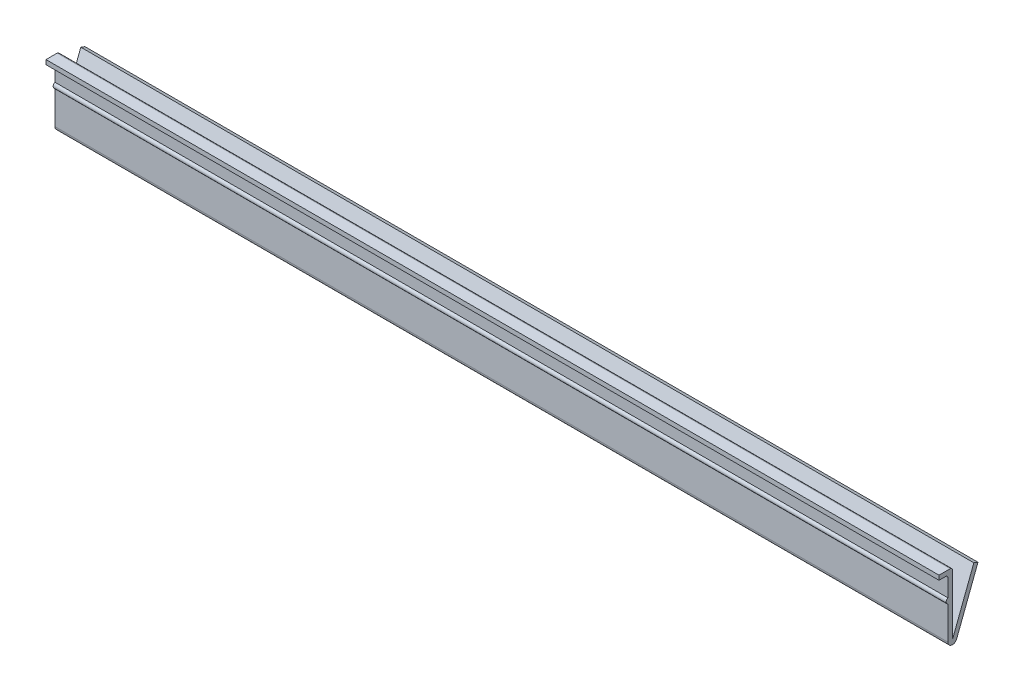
from build123d import *

# Parameters (mm, degrees)
ASENNUSLISTAT_1_6002_ASENNUSLISTA_45_1_DEPTH = 200


with BuildPart() as part:
    # Sketch1 → Asennuslistat 1.6002 ASENNUSLISTA 45_1 (new body)
    with BuildSketch(Plane(origin=(0, 0, 0), x_dir=(0, 0, -1), z_dir=(1, 0, 0))):
        with BuildLine():
            Line((-5.031152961, 10.117620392), (-2.531152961, 10.117620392))
            ThreePointArc((-2.531152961, 10.117620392), (-2.17759957, 9.971173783), (-2.031152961, 9.617620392))
            Line((-2.031152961, 9.617620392), (-2.031152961, -3.876083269))
            ThreePointArc((-2.031152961, -3.876083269), (-2.025913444, -3.882379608), (-2.018769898, -3.878371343))
            Line((-2.018769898, -3.878371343), (2.762345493, 8.617620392))
            Line((2.762345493, 8.617620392), (3.696316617, 8.260271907))
            Line((3.696316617, 8.260271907), (-1.084798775, -4.235719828))
            ThreePointArc((-1.084798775, -4.235719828), (-2.2076122, -4.865733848), (-3.031152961, -3.876083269))
            Line((-3.031152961, -3.876083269), (-3.031152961, 3.517877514))
            ThreePointArc((-3.031152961, 3.517877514), (-3.430536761, 4.117620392), (-3.031152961, 4.717363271))
            Line((-3.031152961, 4.717363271), (-3.031152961, 8.617620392))
            ThreePointArc((-3.031152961, 8.617620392), (-3.17759957, 8.971173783), (-3.531152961, 9.117620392))
            Line((-3.531152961, 9.117620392), (-5.031152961, 9.117620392))
            Line((-5.031152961, 9.117620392), (-5.031152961, 10.117620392))
        make_face()
    extrude(amount=ASENNUSLISTAT_1_6002_ASENNUSLISTA_45_1_DEPTH)


solid = part.part
